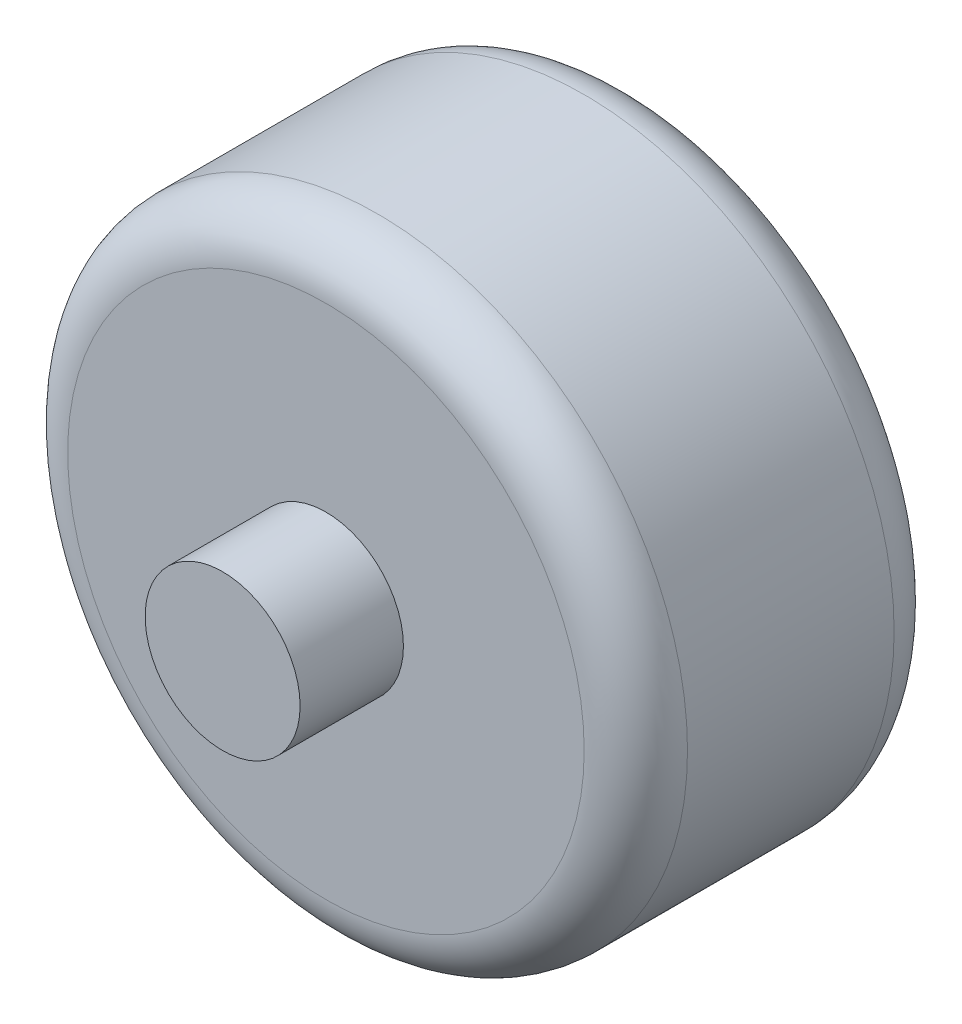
ISO-10303-21;
HEADER;
FILE_DESCRIPTION(('STEP AP214'),'2;1');
FILE_NAME('part.step','',(''),(''),'','','');
FILE_SCHEMA(('AUTOMOTIVE_DESIGN { 1 0 10303 214 1 1 1 1 }'));
ENDSEC;
DATA;
#1=APPLICATION_CONTEXT('core data for automotive mechanical design processes');
#2=APPLICATION_PROTOCOL_DEFINITION('international standard','automotive_design',2000,#1);
#3=PRODUCT_CONTEXT('',#1,'mechanical');
#4=PRODUCT('Part','Part','',(#3));
#5=PRODUCT_RELATED_PRODUCT_CATEGORY('part','',(#4));
#6=PRODUCT_DEFINITION_FORMATION('','',#4);
#7=PRODUCT_DEFINITION_CONTEXT('part definition',#1,'design');
#8=PRODUCT_DEFINITION('design','',#6,#7);
#9=PRODUCT_DEFINITION_SHAPE('','',#8);
#10=(LENGTH_UNIT() NAMED_UNIT(*) SI_UNIT(.MILLI.,.METRE.));
#11=(NAMED_UNIT(*) PLANE_ANGLE_UNIT() SI_UNIT($,.RADIAN.));
#12=(NAMED_UNIT(*) SI_UNIT($,.STERADIAN.) SOLID_ANGLE_UNIT());
#13=UNCERTAINTY_MEASURE_WITH_UNIT(LENGTH_MEASURE(1.E-05),#10,'distance_accuracy_value','');
#14=(GEOMETRIC_REPRESENTATION_CONTEXT(3) GLOBAL_UNCERTAINTY_ASSIGNED_CONTEXT((#13)) GLOBAL_UNIT_ASSIGNED_CONTEXT((#10,
#11,#12)) REPRESENTATION_CONTEXT('',''));
#15=CARTESIAN_POINT('',(0.,0.,0.));
#16=DIRECTION('',(0.,0.,1.));
#17=DIRECTION('',(1.,0.,0.));
#18=AXIS2_PLACEMENT_3D('',#15,#16,#17);
#19=CARTESIAN_POINT('',(0.,0.,30.));
#20=DIRECTION('',(0.,0.,1.));
#21=DIRECTION('',(1.,0.,0.));
#22=AXIS2_PLACEMENT_3D('',#19,#20,#21);
#23=PLANE('',#22);
#24=CARTESIAN_POINT('',(0.,0.,30.));
#25=DIRECTION('',(0.,0.,1.));
#26=DIRECTION('',(1.,0.,0.));
#27=AXIS2_PLACEMENT_3D('',#24,#25,#26);
#28=CIRCLE('',#27,50.);
#29=CARTESIAN_POINT('',(50.,0.,30.));
#30=VERTEX_POINT('',#29);
#31=EDGE_CURVE('E10',#30,#30,#28,.T.);
#32=ORIENTED_EDGE('',*,*,#31,.T.);
#33=EDGE_LOOP('',(#32));
#34=FACE_BOUND('',#33,.T.);
#35=CARTESIAN_POINT('',(0.,0.,30.));
#36=DIRECTION('',(0.,0.,1.));
#37=DIRECTION('',(1.,0.,0.));
#38=AXIS2_PLACEMENT_3D('',#35,#36,#37);
#39=CIRCLE('',#38,15.);
#40=CARTESIAN_POINT('',(15.,0.,30.));
#41=VERTEX_POINT('',#40);
#42=EDGE_CURVE('E51',#41,#41,#39,.T.);
#43=ORIENTED_EDGE('',*,*,#42,.F.);
#44=EDGE_LOOP('',(#43));
#45=FACE_BOUND('',#44,.T.);
#46=ADVANCED_FACE('F31',(#34,#45),#23,.T.);
#47=CARTESIAN_POINT('',(0.,0.,-30.));
#48=DIRECTION('',(0.,0.,1.));
#49=DIRECTION('',(1.,0.,0.));
#50=AXIS2_PLACEMENT_3D('',#47,#48,#49);
#51=PLANE('',#50);
#52=CARTESIAN_POINT('',(0.,0.,-30.));
#53=DIRECTION('',(0.,0.,1.));
#54=DIRECTION('',(1.,0.,0.));
#55=AXIS2_PLACEMENT_3D('',#52,#53,#54);
#56=CIRCLE('',#55,50.);
#57=CARTESIAN_POINT('',(50.,0.,-30.));
#58=VERTEX_POINT('',#57);
#59=EDGE_CURVE('E38',#58,#58,#56,.F.);
#60=ORIENTED_EDGE('',*,*,#59,.T.);
#61=EDGE_LOOP('',(#60));
#62=FACE_BOUND('',#61,.T.);
#63=CARTESIAN_POINT('',(0.,0.,-30.));
#64=DIRECTION('',(0.,0.,1.));
#65=DIRECTION('',(1.,0.,0.));
#66=AXIS2_PLACEMENT_3D('',#63,#64,#65);
#67=CIRCLE('',#66,15.);
#68=CARTESIAN_POINT('',(15.,0.,-30.));
#69=VERTEX_POINT('',#68);
#70=EDGE_CURVE('E54',#69,#69,#67,.F.);
#71=ORIENTED_EDGE('',*,*,#70,.F.);
#72=EDGE_LOOP('',(#71));
#73=FACE_BOUND('',#72,.T.);
#74=ADVANCED_FACE('F82',(#62,#73),#51,.F.);
#75=CARTESIAN_POINT('',(0.,0.,30.));
#76=DIRECTION('',(0.,0.,-1.));
#77=DIRECTION('',(-1.,0.,0.));
#78=AXIS2_PLACEMENT_3D('',#75,#76,#77);
#79=CYLINDRICAL_SURFACE('',#78,60.);
#80=CARTESIAN_POINT('',(0.,0.,-20.));
#81=DIRECTION('',(0.,0.,1.));
#82=DIRECTION('',(1.,0.,0.));
#83=AXIS2_PLACEMENT_3D('',#80,#81,#82);
#84=CIRCLE('',#83,60.);
#85=CARTESIAN_POINT('',(60.,0.,-20.));
#86=VERTEX_POINT('',#85);
#87=EDGE_CURVE('E42',#86,#86,#84,.T.);
#88=ORIENTED_EDGE('',*,*,#87,.T.);
#89=EDGE_LOOP('',(#88));
#90=FACE_BOUND('',#89,.T.);
#91=CARTESIAN_POINT('',(0.,0.,20.));
#92=DIRECTION('',(0.,0.,1.));
#93=DIRECTION('',(1.,0.,0.));
#94=AXIS2_PLACEMENT_3D('',#91,#92,#93);
#95=CIRCLE('',#94,60.);
#96=CARTESIAN_POINT('',(60.,0.,20.));
#97=VERTEX_POINT('',#96);
#98=EDGE_CURVE('E46',#97,#97,#95,.F.);
#99=ORIENTED_EDGE('',*,*,#98,.T.);
#100=EDGE_LOOP('',(#99));
#101=FACE_BOUND('',#100,.T.);
#102=ADVANCED_FACE('F86',(#90,#101),#79,.T.);
#103=CARTESIAN_POINT('',(0.,0.,-50.));
#104=DIRECTION('',(0.,0.,1.));
#105=DIRECTION('',(1.,0.,0.));
#106=AXIS2_PLACEMENT_3D('',#103,#104,#105);
#107=PLANE('',#106);
#108=CARTESIAN_POINT('',(0.,0.,-50.));
#109=DIRECTION('',(0.,0.,1.));
#110=DIRECTION('',(1.,0.,0.));
#111=AXIS2_PLACEMENT_3D('',#108,#109,#110);
#112=CIRCLE('',#111,15.);
#113=CARTESIAN_POINT('',(15.,0.,-50.));
#114=VERTEX_POINT('',#113);
#115=EDGE_CURVE('E58',#114,#114,#112,.T.);
#116=ORIENTED_EDGE('',*,*,#115,.F.);
#117=EDGE_LOOP('',(#116));
#118=FACE_BOUND('',#117,.T.);
#119=ADVANCED_FACE('F77',(#118),#107,.F.);
#120=CARTESIAN_POINT('',(0.,0.,50.));
#121=DIRECTION('',(0.,0.,-1.));
#122=DIRECTION('',(-1.,0.,0.));
#123=AXIS2_PLACEMENT_3D('',#120,#121,#122);
#124=CYLINDRICAL_SURFACE('',#123,15.);
#125=ORIENTED_EDGE('',*,*,#115,.T.);
#126=EDGE_LOOP('',(#125));
#127=FACE_BOUND('',#126,.T.);
#128=ORIENTED_EDGE('',*,*,#70,.T.);
#129=EDGE_LOOP('',(#128));
#130=FACE_BOUND('',#129,.T.);
#131=ADVANCED_FACE('F68',(#127,#130),#124,.T.);
#132=ORIENTED_EDGE('',*,*,#42,.T.);
#133=EDGE_LOOP('',(#132));
#134=FACE_BOUND('',#133,.T.);
#135=CARTESIAN_POINT('',(0.,0.,50.));
#136=DIRECTION('',(0.,0.,1.));
#137=DIRECTION('',(1.,0.,0.));
#138=AXIS2_PLACEMENT_3D('',#135,#136,#137);
#139=CIRCLE('',#138,15.);
#140=CARTESIAN_POINT('',(15.,0.,50.));
#141=VERTEX_POINT('',#140);
#142=EDGE_CURVE('E57',#141,#141,#139,.T.);
#143=ORIENTED_EDGE('',*,*,#142,.F.);
#144=EDGE_LOOP('',(#143));
#145=FACE_BOUND('',#144,.T.);
#146=ADVANCED_FACE('F66',(#134,#145),#124,.T.);
#147=CARTESIAN_POINT('',(0.,0.,50.));
#148=DIRECTION('',(0.,0.,1.));
#149=DIRECTION('',(1.,0.,0.));
#150=AXIS2_PLACEMENT_3D('',#147,#148,#149);
#151=PLANE('',#150);
#152=ORIENTED_EDGE('',*,*,#142,.T.);
#153=EDGE_LOOP('',(#152));
#154=FACE_BOUND('',#153,.T.);
#155=ADVANCED_FACE('F64',(#154),#151,.T.);
#156=CARTESIAN_POINT('',(0.,0.,-20.));
#157=DIRECTION('',(0.,0.,1.));
#158=DIRECTION('',(1.,0.,0.));
#159=AXIS2_PLACEMENT_3D('',#156,#157,#158);
#160=TOROIDAL_SURFACE('',#159,50.,10.);
#161=ORIENTED_EDGE('',*,*,#59,.F.);
#162=EDGE_LOOP('',(#161));
#163=FACE_BOUND('',#162,.T.);
#164=ORIENTED_EDGE('',*,*,#87,.F.);
#165=EDGE_LOOP('',(#164));
#166=FACE_BOUND('',#165,.T.);
#167=ADVANCED_FACE('F75',(#163,#166),#160,.T.);
#168=CARTESIAN_POINT('',(0.,0.,20.));
#169=DIRECTION('',(0.,0.,1.));
#170=DIRECTION('',(1.,0.,0.));
#171=AXIS2_PLACEMENT_3D('',#168,#169,#170);
#172=TOROIDAL_SURFACE('',#171,50.,10.);
#173=ORIENTED_EDGE('',*,*,#98,.F.);
#174=EDGE_LOOP('',(#173));
#175=FACE_BOUND('',#174,.T.);
#176=ORIENTED_EDGE('',*,*,#31,.F.);
#177=EDGE_LOOP('',(#176));
#178=FACE_BOUND('',#177,.T.);
#179=ADVANCED_FACE('F33',(#175,#178),#172,.T.);
#180=CLOSED_SHELL('',(#46,#74,#102,#119,#131,#146,#155,#167,#179));
#181=MANIFOLD_SOLID_BREP('B2',#180);
#182=ADVANCED_BREP_SHAPE_REPRESENTATION('',(#18,#181),#14);
#183=SHAPE_DEFINITION_REPRESENTATION(#9,#182);
ENDSEC;
END-ISO-10303-21;
